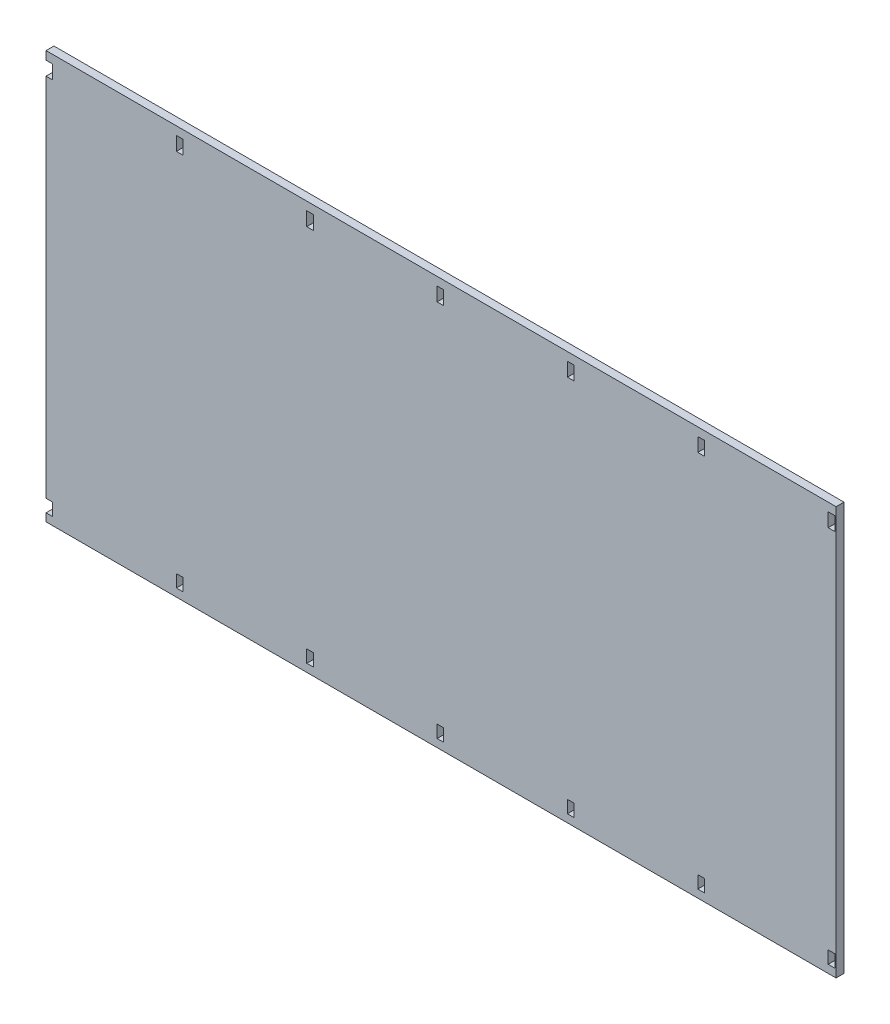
from build123d import *

# Parameters (mm, degrees)
CROQUIS1_W              = 2.52
CROQUIS1_H              = 5.24
CROQUIS1_H_2            = 4.76
SALIENTE_EXTRUIR1_DEPTH = 3


with BuildPart() as part:
    # Croquis1 → Saliente-Extruir1 (new body)
    with BuildSketch(Plane.XY):
        Polygon((-150, 77.5), (150, 77.5), (150, -77.5), (-150, -77.5), (-150, -74.5), (-147.48, -74.5), (-147.48, -69.74), (-150, -69.74), (-150, 69.09), (-147.48, 69.09), (-147.48, 74.33), (-150, 74.33), align=None)
        with Locations((-99.24, 71.71)):
            Rectangle(CROQUIS1_W, CROQUIS1_H, mode=Mode.SUBTRACT)
        with Locations((-49.74, 71.71)):
            Rectangle(CROQUIS1_W, CROQUIS1_H, mode=Mode.SUBTRACT)
        with Locations((-0.24, 71.71)):
            Rectangle(CROQUIS1_W, CROQUIS1_H, mode=Mode.SUBTRACT)
        with Locations((49.26, 71.71)):
            Rectangle(CROQUIS1_W, CROQUIS1_H, mode=Mode.SUBTRACT)
        with Locations((98.76, 71.71)):
            Rectangle(CROQUIS1_W, CROQUIS1_H, mode=Mode.SUBTRACT)
        with Locations((148.26, 71.71)):
            Rectangle(CROQUIS1_W, CROQUIS1_H, mode=Mode.SUBTRACT)
        with Locations((-99.24, -72.12)):
            Rectangle(CROQUIS1_W, CROQUIS1_H_2, mode=Mode.SUBTRACT)
        with Locations((-49.74, -72.12)):
            Rectangle(CROQUIS1_W, CROQUIS1_H_2, mode=Mode.SUBTRACT)
        with Locations((-0.24, -72.12)):
            Rectangle(CROQUIS1_W, CROQUIS1_H_2, mode=Mode.SUBTRACT)
        with Locations((49.26, -72.12)):
            Rectangle(CROQUIS1_W, CROQUIS1_H_2, mode=Mode.SUBTRACT)
        with Locations((98.76, -72.12)):
            Rectangle(CROQUIS1_W, CROQUIS1_H_2, mode=Mode.SUBTRACT)
        with Locations((148.26, -72.12)):
            Rectangle(CROQUIS1_W, CROQUIS1_H_2, mode=Mode.SUBTRACT)
    extrude(amount=SALIENTE_EXTRUIR1_DEPTH)


solid = part.part
